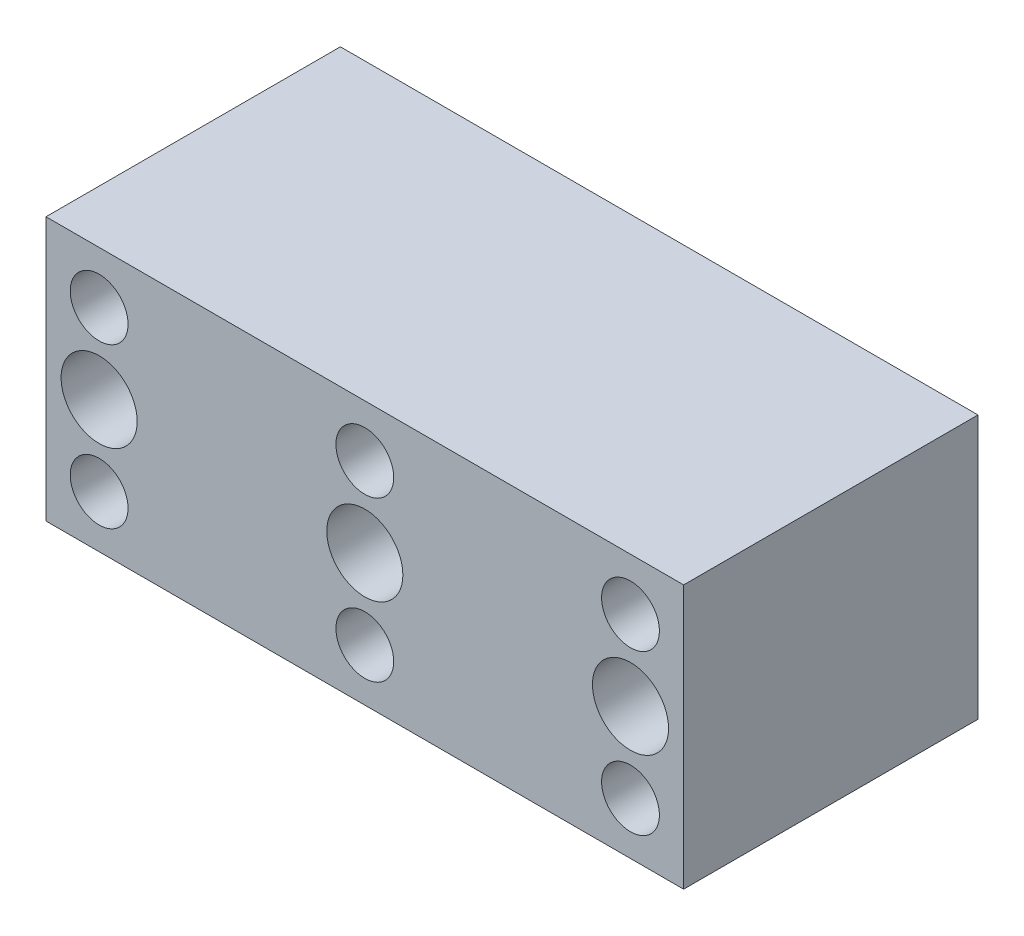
ISO-10303-21;
HEADER;
FILE_DESCRIPTION(('STEP AP214'),'2;1');
FILE_NAME('part.step','',(''),(''),'','','');
FILE_SCHEMA(('AUTOMOTIVE_DESIGN { 1 0 10303 214 1 1 1 1 }'));
ENDSEC;
DATA;
#1=APPLICATION_CONTEXT('core data for automotive mechanical design processes');
#2=APPLICATION_PROTOCOL_DEFINITION('international standard','automotive_design',2000,#1);
#3=PRODUCT_CONTEXT('',#1,'mechanical');
#4=PRODUCT('Part','Part','',(#3));
#5=PRODUCT_RELATED_PRODUCT_CATEGORY('part','',(#4));
#6=PRODUCT_DEFINITION_FORMATION('','',#4);
#7=PRODUCT_DEFINITION_CONTEXT('part definition',#1,'design');
#8=PRODUCT_DEFINITION('design','',#6,#7);
#9=PRODUCT_DEFINITION_SHAPE('','',#8);
#10=(LENGTH_UNIT() NAMED_UNIT(*) SI_UNIT(.MILLI.,.METRE.));
#11=(NAMED_UNIT(*) PLANE_ANGLE_UNIT() SI_UNIT($,.RADIAN.));
#12=(NAMED_UNIT(*) SI_UNIT($,.STERADIAN.) SOLID_ANGLE_UNIT());
#13=UNCERTAINTY_MEASURE_WITH_UNIT(LENGTH_MEASURE(1.E-05),#10,'distance_accuracy_value','');
#14=(GEOMETRIC_REPRESENTATION_CONTEXT(3) GLOBAL_UNCERTAINTY_ASSIGNED_CONTEXT((#13)) GLOBAL_UNIT_ASSIGNED_CONTEXT((#10,
#11,#12)) REPRESENTATION_CONTEXT('',''));
#15=CARTESIAN_POINT('',(0.,0.,0.));
#16=DIRECTION('',(0.,0.,1.));
#17=DIRECTION('',(1.,0.,0.));
#18=AXIS2_PLACEMENT_3D('',#15,#16,#17);
#19=CARTESIAN_POINT('',(6.35,25.273,-35.179));
#20=DIRECTION('',(0.,0.,1.));
#21=DIRECTION('',(1.,0.,0.));
#22=AXIS2_PLACEMENT_3D('',#19,#20,#21);
#23=CYLINDRICAL_SURFACE('',#22,2.1082);
#24=CARTESIAN_POINT('',(6.35,25.273,-35.179));
#25=DIRECTION('',(0.,0.,1.));
#26=DIRECTION('',(1.,0.,0.));
#27=AXIS2_PLACEMENT_3D('',#24,#25,#26);
#28=CIRCLE('',#27,2.1082);
#29=CARTESIAN_POINT('',(8.4582,25.273,-35.179));
#30=VERTEX_POINT('',#29);
#31=EDGE_CURVE('E107',#30,#30,#28,.T.);
#32=ORIENTED_EDGE('',*,*,#31,.F.);
#33=EDGE_LOOP('',(#32));
#34=FACE_BOUND('',#33,.T.);
#35=CARTESIAN_POINT('',(6.35,25.273,-5.08));
#36=DIRECTION('',(0.,0.,1.));
#37=DIRECTION('',(1.,0.,0.));
#38=AXIS2_PLACEMENT_3D('',#35,#36,#37);
#39=CIRCLE('',#38,2.1082);
#40=CARTESIAN_POINT('',(8.4582,25.273,-5.08));
#41=VERTEX_POINT('',#40);
#42=EDGE_CURVE('E39',#41,#41,#39,.F.);
#43=ORIENTED_EDGE('',*,*,#42,.F.);
#44=EDGE_LOOP('',(#43));
#45=FACE_BOUND('',#44,.T.);
#46=ADVANCED_FACE('F35',(#34,#45),#23,.F.);
#47=CARTESIAN_POINT('',(38.1,25.273,-35.179));
#48=DIRECTION('',(0.,0.,1.));
#49=DIRECTION('',(1.,0.,0.));
#50=AXIS2_PLACEMENT_3D('',#47,#48,#49);
#51=CYLINDRICAL_SURFACE('',#50,2.1082);
#52=CARTESIAN_POINT('',(38.1,25.273,-35.179));
#53=DIRECTION('',(0.,0.,1.));
#54=DIRECTION('',(1.,0.,0.));
#55=AXIS2_PLACEMENT_3D('',#52,#53,#54);
#56=CIRCLE('',#55,2.1082);
#57=CARTESIAN_POINT('',(40.2082,25.273,-35.179));
#58=VERTEX_POINT('',#57);
#59=EDGE_CURVE('E144',#58,#58,#56,.T.);
#60=ORIENTED_EDGE('',*,*,#59,.F.);
#61=EDGE_LOOP('',(#60));
#62=FACE_BOUND('',#61,.T.);
#63=CARTESIAN_POINT('',(38.1,25.273,-5.08));
#64=DIRECTION('',(0.,0.,1.));
#65=DIRECTION('',(1.,0.,0.));
#66=AXIS2_PLACEMENT_3D('',#63,#64,#65);
#67=CIRCLE('',#66,2.1082);
#68=CARTESIAN_POINT('',(40.2082,25.273,-5.08));
#69=VERTEX_POINT('',#68);
#70=EDGE_CURVE('E126',#69,#69,#67,.F.);
#71=ORIENTED_EDGE('',*,*,#70,.F.);
#72=EDGE_LOOP('',(#71));
#73=FACE_BOUND('',#72,.T.);
#74=ADVANCED_FACE('F189',(#62,#73),#51,.F.);
#75=CARTESIAN_POINT('',(69.85,25.273,-35.179));
#76=DIRECTION('',(0.,0.,1.));
#77=DIRECTION('',(1.,0.,0.));
#78=AXIS2_PLACEMENT_3D('',#75,#76,#77);
#79=CYLINDRICAL_SURFACE('',#78,2.1082);
#80=CARTESIAN_POINT('',(69.85,25.273,-35.179));
#81=DIRECTION('',(0.,0.,1.));
#82=DIRECTION('',(1.,0.,0.));
#83=AXIS2_PLACEMENT_3D('',#80,#81,#82);
#84=CIRCLE('',#83,2.1082);
#85=CARTESIAN_POINT('',(71.9582,25.273,-35.179));
#86=VERTEX_POINT('',#85);
#87=EDGE_CURVE('E148',#86,#86,#84,.T.);
#88=ORIENTED_EDGE('',*,*,#87,.F.);
#89=EDGE_LOOP('',(#88));
#90=FACE_BOUND('',#89,.T.);
#91=CARTESIAN_POINT('',(69.85,25.273,-5.08));
#92=DIRECTION('',(0.,0.,1.));
#93=DIRECTION('',(1.,0.,0.));
#94=AXIS2_PLACEMENT_3D('',#91,#92,#93);
#95=CIRCLE('',#94,2.1082);
#96=CARTESIAN_POINT('',(71.9582,25.273,-5.08));
#97=VERTEX_POINT('',#96);
#98=EDGE_CURVE('E124',#97,#97,#95,.F.);
#99=ORIENTED_EDGE('',*,*,#98,.F.);
#100=EDGE_LOOP('',(#99));
#101=FACE_BOUND('',#100,.T.);
#102=ADVANCED_FACE('F166',(#90,#101),#79,.F.);
#103=CARTESIAN_POINT('',(69.85,6.223,-35.179));
#104=DIRECTION('',(0.,0.,1.));
#105=DIRECTION('',(1.,0.,0.));
#106=AXIS2_PLACEMENT_3D('',#103,#104,#105);
#107=CYLINDRICAL_SURFACE('',#106,2.1082);
#108=CARTESIAN_POINT('',(69.85,6.223,-35.179));
#109=DIRECTION('',(0.,0.,1.));
#110=DIRECTION('',(1.,0.,0.));
#111=AXIS2_PLACEMENT_3D('',#108,#109,#110);
#112=CIRCLE('',#111,2.1082);
#113=CARTESIAN_POINT('',(71.9582,6.223,-35.179));
#114=VERTEX_POINT('',#113);
#115=EDGE_CURVE('E140',#114,#114,#112,.T.);
#116=ORIENTED_EDGE('',*,*,#115,.F.);
#117=EDGE_LOOP('',(#116));
#118=FACE_BOUND('',#117,.T.);
#119=CARTESIAN_POINT('',(69.85,6.223,-5.08));
#120=DIRECTION('',(0.,0.,1.));
#121=DIRECTION('',(1.,0.,0.));
#122=AXIS2_PLACEMENT_3D('',#119,#120,#121);
#123=CIRCLE('',#122,2.1082);
#124=CARTESIAN_POINT('',(71.9582,6.223,-5.08));
#125=VERTEX_POINT('',#124);
#126=EDGE_CURVE('E121',#125,#125,#123,.F.);
#127=ORIENTED_EDGE('',*,*,#126,.F.);
#128=EDGE_LOOP('',(#127));
#129=FACE_BOUND('',#128,.T.);
#130=ADVANCED_FACE('F162',(#118,#129),#107,.F.);
#131=CARTESIAN_POINT('',(38.1,6.223,-35.179));
#132=DIRECTION('',(0.,0.,1.));
#133=DIRECTION('',(1.,0.,0.));
#134=AXIS2_PLACEMENT_3D('',#131,#132,#133);
#135=CYLINDRICAL_SURFACE('',#134,2.1082);
#136=CARTESIAN_POINT('',(38.1,6.223,-35.179));
#137=DIRECTION('',(0.,0.,1.));
#138=DIRECTION('',(1.,0.,0.));
#139=AXIS2_PLACEMENT_3D('',#136,#137,#138);
#140=CIRCLE('',#139,2.1082);
#141=CARTESIAN_POINT('',(40.2082,6.223,-35.179));
#142=VERTEX_POINT('',#141);
#143=EDGE_CURVE('E135',#142,#142,#140,.T.);
#144=ORIENTED_EDGE('',*,*,#143,.F.);
#145=EDGE_LOOP('',(#144));
#146=FACE_BOUND('',#145,.T.);
#147=CARTESIAN_POINT('',(38.1,6.223,-5.08));
#148=DIRECTION('',(0.,0.,1.));
#149=DIRECTION('',(1.,0.,0.));
#150=AXIS2_PLACEMENT_3D('',#147,#148,#149);
#151=CIRCLE('',#150,2.1082);
#152=CARTESIAN_POINT('',(40.2082,6.223,-5.08));
#153=VERTEX_POINT('',#152);
#154=EDGE_CURVE('E117',#153,#153,#151,.F.);
#155=ORIENTED_EDGE('',*,*,#154,.F.);
#156=EDGE_LOOP('',(#155));
#157=FACE_BOUND('',#156,.T.);
#158=ADVANCED_FACE('F165',(#146,#157),#135,.F.);
#159=CARTESIAN_POINT('',(6.35,6.22299999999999,-35.179));
#160=DIRECTION('',(0.,0.,1.));
#161=DIRECTION('',(1.,0.,0.));
#162=AXIS2_PLACEMENT_3D('',#159,#160,#161);
#163=CYLINDRICAL_SURFACE('',#162,2.1082);
#164=CARTESIAN_POINT('',(6.35,6.22299999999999,-35.179));
#165=DIRECTION('',(0.,0.,1.));
#166=DIRECTION('',(1.,0.,0.));
#167=AXIS2_PLACEMENT_3D('',#164,#165,#166);
#168=CIRCLE('',#167,2.1082);
#169=CARTESIAN_POINT('',(8.4582,6.22299999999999,-35.179));
#170=VERTEX_POINT('',#169);
#171=EDGE_CURVE('E131',#170,#170,#168,.T.);
#172=ORIENTED_EDGE('',*,*,#171,.F.);
#173=EDGE_LOOP('',(#172));
#174=FACE_BOUND('',#173,.T.);
#175=CARTESIAN_POINT('',(6.35,6.22299999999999,-5.08));
#176=DIRECTION('',(0.,0.,1.));
#177=DIRECTION('',(1.,0.,0.));
#178=AXIS2_PLACEMENT_3D('',#175,#176,#177);
#179=CIRCLE('',#178,2.1082);
#180=CARTESIAN_POINT('',(8.4582,6.22299999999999,-5.08));
#181=VERTEX_POINT('',#180);
#182=EDGE_CURVE('E114',#181,#181,#179,.F.);
#183=ORIENTED_EDGE('',*,*,#182,.F.);
#184=EDGE_LOOP('',(#183));
#185=FACE_BOUND('',#184,.T.);
#186=ADVANCED_FACE('F200',(#174,#185),#163,.F.);
#187=CARTESIAN_POINT('',(0.,0.,-35.179));
#188=DIRECTION('',(-1.,0.,0.));
#189=DIRECTION('',(0.,0.,1.));
#190=AXIS2_PLACEMENT_3D('',#187,#188,#189);
#191=PLANE('',#190);
#192=DIRECTION('',(0.,-1.,0.));
#193=VECTOR('',#192,1.);
#194=CARTESIAN_POINT('',(0.,0.,0.));
#195=LINE('',#194,#193);
#196=CARTESIAN_POINT('',(0.,31.496,0.));
#197=VERTEX_POINT('',#196);
#198=CARTESIAN_POINT('',(0.,0.,0.));
#199=VERTEX_POINT('',#198);
#200=EDGE_CURVE('E103',#197,#199,#195,.T.);
#201=ORIENTED_EDGE('',*,*,#200,.F.);
#202=DIRECTION('',(0.,0.,1.));
#203=VECTOR('',#202,1.);
#204=CARTESIAN_POINT('',(0.,31.496,-35.179));
#205=LINE('',#204,#203);
#206=CARTESIAN_POINT('',(0.,31.496,-35.179));
#207=VERTEX_POINT('',#206);
#208=EDGE_CURVE('E11',#207,#197,#205,.T.);
#209=ORIENTED_EDGE('',*,*,#208,.F.);
#210=DIRECTION('',(0.,-1.,0.));
#211=VECTOR('',#210,1.);
#212=CARTESIAN_POINT('',(0.,0.,-35.179));
#213=LINE('',#212,#211);
#214=CARTESIAN_POINT('',(0.,0.,-35.179));
#215=VERTEX_POINT('',#214);
#216=EDGE_CURVE('E96',#207,#215,#213,.T.);
#217=ORIENTED_EDGE('',*,*,#216,.T.);
#218=DIRECTION('',(0.,0.,1.));
#219=VECTOR('',#218,1.);
#220=CARTESIAN_POINT('',(0.,0.,-35.179));
#221=LINE('',#220,#219);
#222=EDGE_CURVE('E79',#215,#199,#221,.T.);
#223=ORIENTED_EDGE('',*,*,#222,.T.);
#224=EDGE_LOOP('',(#201,#209,#217,#223));
#225=FACE_BOUND('',#224,.T.);
#226=ADVANCED_FACE('F37',(#225),#191,.T.);
#227=CARTESIAN_POINT('',(0.,31.496,-35.179));
#228=DIRECTION('',(0.,1.,0.));
#229=DIRECTION('',(0.,0.,1.));
#230=AXIS2_PLACEMENT_3D('',#227,#228,#229);
#231=PLANE('',#230);
#232=DIRECTION('',(-1.,0.,0.));
#233=VECTOR('',#232,1.);
#234=CARTESIAN_POINT('',(0.,31.496,0.));
#235=LINE('',#234,#233);
#236=CARTESIAN_POINT('',(76.2,31.496,0.));
#237=VERTEX_POINT('',#236);
#238=EDGE_CURVE('E98',#237,#197,#235,.T.);
#239=ORIENTED_EDGE('',*,*,#238,.F.);
#240=DIRECTION('',(0.,0.,1.));
#241=VECTOR('',#240,1.);
#242=CARTESIAN_POINT('',(76.2,31.496,-35.179));
#243=LINE('',#242,#241);
#244=CARTESIAN_POINT('',(76.2,31.496,-35.179));
#245=VERTEX_POINT('',#244);
#246=EDGE_CURVE('E45',#245,#237,#243,.T.);
#247=ORIENTED_EDGE('',*,*,#246,.F.);
#248=DIRECTION('',(-1.,0.,0.));
#249=VECTOR('',#248,1.);
#250=CARTESIAN_POINT('',(0.,31.496,-35.179));
#251=LINE('',#250,#249);
#252=EDGE_CURVE('E93',#245,#207,#251,.T.);
#253=ORIENTED_EDGE('',*,*,#252,.T.);
#254=ORIENTED_EDGE('',*,*,#208,.T.);
#255=EDGE_LOOP('',(#239,#247,#253,#254));
#256=FACE_BOUND('',#255,.T.);
#257=ADVANCED_FACE('F210',(#256),#231,.T.);
#258=CARTESIAN_POINT('',(76.2,0.,-35.179));
#259=DIRECTION('',(1.,0.,0.));
#260=DIRECTION('',(0.,0.,-1.));
#261=AXIS2_PLACEMENT_3D('',#258,#259,#260);
#262=PLANE('',#261);
#263=DIRECTION('',(0.,1.,0.));
#264=VECTOR('',#263,1.);
#265=CARTESIAN_POINT('',(76.2,0.,0.));
#266=LINE('',#265,#264);
#267=CARTESIAN_POINT('',(76.2,0.,0.));
#268=VERTEX_POINT('',#267);
#269=EDGE_CURVE('E87',#268,#237,#266,.T.);
#270=ORIENTED_EDGE('',*,*,#269,.F.);
#271=DIRECTION('',(0.,0.,1.));
#272=VECTOR('',#271,1.);
#273=CARTESIAN_POINT('',(76.2,0.,-35.179));
#274=LINE('',#273,#272);
#275=CARTESIAN_POINT('',(76.2,0.,-35.179));
#276=VERTEX_POINT('',#275);
#277=EDGE_CURVE('E82',#276,#268,#274,.T.);
#278=ORIENTED_EDGE('',*,*,#277,.F.);
#279=DIRECTION('',(0.,1.,0.));
#280=VECTOR('',#279,1.);
#281=CARTESIAN_POINT('',(76.2,0.,-35.179));
#282=LINE('',#281,#280);
#283=EDGE_CURVE('E85',#276,#245,#282,.T.);
#284=ORIENTED_EDGE('',*,*,#283,.T.);
#285=ORIENTED_EDGE('',*,*,#246,.T.);
#286=EDGE_LOOP('',(#270,#278,#284,#285));
#287=FACE_BOUND('',#286,.T.);
#288=ADVANCED_FACE('F84',(#287),#262,.T.);
#289=CARTESIAN_POINT('',(0.,0.,-35.179));
#290=DIRECTION('',(0.,-1.,0.));
#291=DIRECTION('',(0.,0.,-1.));
#292=AXIS2_PLACEMENT_3D('',#289,#290,#291);
#293=PLANE('',#292);
#294=DIRECTION('',(1.,0.,0.));
#295=VECTOR('',#294,1.);
#296=CARTESIAN_POINT('',(0.,0.,0.));
#297=LINE('',#296,#295);
#298=EDGE_CURVE('E106',#199,#268,#297,.T.);
#299=ORIENTED_EDGE('',*,*,#298,.F.);
#300=ORIENTED_EDGE('',*,*,#222,.F.);
#301=DIRECTION('',(1.,0.,0.));
#302=VECTOR('',#301,1.);
#303=CARTESIAN_POINT('',(0.,0.,-35.179));
#304=LINE('',#303,#302);
#305=EDGE_CURVE('E92',#215,#276,#304,.T.);
#306=ORIENTED_EDGE('',*,*,#305,.T.);
#307=ORIENTED_EDGE('',*,*,#277,.T.);
#308=EDGE_LOOP('',(#299,#300,#306,#307));
#309=FACE_BOUND('',#308,.T.);
#310=ADVANCED_FACE('F95',(#309),#293,.T.);
#311=CARTESIAN_POINT('',(0.,0.,-35.179));
#312=DIRECTION('',(0.,0.,-1.));
#313=DIRECTION('',(-1.,0.,0.));
#314=AXIS2_PLACEMENT_3D('',#311,#312,#313);
#315=PLANE('',#314);
#316=CARTESIAN_POINT('',(6.35,15.748,-35.179));
#317=DIRECTION('',(0.,0.,1.));
#318=DIRECTION('',(1.,0.,0.));
#319=AXIS2_PLACEMENT_3D('',#316,#317,#318);
#320=CIRCLE('',#319,4.54659999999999);
#321=CARTESIAN_POINT('',(10.8966,15.748,-35.179));
#322=VERTEX_POINT('',#321);
#323=EDGE_CURVE('E365',#322,#322,#320,.T.);
#324=ORIENTED_EDGE('',*,*,#323,.T.);
#325=EDGE_LOOP('',(#324));
#326=FACE_BOUND('',#325,.T.);
#327=CARTESIAN_POINT('',(38.1,15.748,-35.179));
#328=DIRECTION('',(0.,0.,1.));
#329=DIRECTION('',(1.,0.,0.));
#330=AXIS2_PLACEMENT_3D('',#327,#328,#329);
#331=CIRCLE('',#330,4.54659999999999);
#332=CARTESIAN_POINT('',(42.6466,15.748,-35.179));
#333=VERTEX_POINT('',#332);
#334=EDGE_CURVE('E375',#333,#333,#331,.T.);
#335=ORIENTED_EDGE('',*,*,#334,.T.);
#336=EDGE_LOOP('',(#335));
#337=FACE_BOUND('',#336,.T.);
#338=CARTESIAN_POINT('',(69.85,15.748,-35.179));
#339=DIRECTION('',(0.,0.,1.));
#340=DIRECTION('',(1.,0.,0.));
#341=AXIS2_PLACEMENT_3D('',#338,#339,#340);
#342=CIRCLE('',#341,4.5466);
#343=CARTESIAN_POINT('',(74.3966,15.748,-35.179));
#344=VERTEX_POINT('',#343);
#345=EDGE_CURVE('E381',#344,#344,#342,.T.);
#346=ORIENTED_EDGE('',*,*,#345,.T.);
#347=EDGE_LOOP('',(#346));
#348=FACE_BOUND('',#347,.T.);
#349=ORIENTED_EDGE('',*,*,#171,.T.);
#350=EDGE_LOOP('',(#349));
#351=FACE_BOUND('',#350,.T.);
#352=ORIENTED_EDGE('',*,*,#143,.T.);
#353=EDGE_LOOP('',(#352));
#354=FACE_BOUND('',#353,.T.);
#355=ORIENTED_EDGE('',*,*,#115,.T.);
#356=EDGE_LOOP('',(#355));
#357=FACE_BOUND('',#356,.T.);
#358=ORIENTED_EDGE('',*,*,#87,.T.);
#359=EDGE_LOOP('',(#358));
#360=FACE_BOUND('',#359,.T.);
#361=ORIENTED_EDGE('',*,*,#59,.T.);
#362=EDGE_LOOP('',(#361));
#363=FACE_BOUND('',#362,.T.);
#364=ORIENTED_EDGE('',*,*,#31,.T.);
#365=EDGE_LOOP('',(#364));
#366=FACE_BOUND('',#365,.T.);
#367=ORIENTED_EDGE('',*,*,#216,.F.);
#368=ORIENTED_EDGE('',*,*,#252,.F.);
#369=ORIENTED_EDGE('',*,*,#283,.F.);
#370=ORIENTED_EDGE('',*,*,#305,.F.);
#371=EDGE_LOOP('',(#367,#368,#369,#370));
#372=FACE_BOUND('',#371,.T.);
#373=ADVANCED_FACE('F91',(#326,#337,#348,#351,#354,#357,#360,#363,#366,#372),#315,.T.);
#374=CARTESIAN_POINT('',(0.,0.,0.));
#375=DIRECTION('',(0.,0.,-1.));
#376=DIRECTION('',(-1.,0.,0.));
#377=AXIS2_PLACEMENT_3D('',#374,#375,#376);
#378=PLANE('',#377);
#379=CARTESIAN_POINT('',(6.35,15.748,0.));
#380=DIRECTION('',(0.,0.,1.));
#381=DIRECTION('',(1.,0.,0.));
#382=AXIS2_PLACEMENT_3D('',#379,#380,#381);
#383=CIRCLE('',#382,4.5466);
#384=CARTESIAN_POINT('',(10.8966,15.748,0.));
#385=VERTEX_POINT('',#384);
#386=EDGE_CURVE('E368',#385,#385,#383,.T.);
#387=ORIENTED_EDGE('',*,*,#386,.F.);
#388=EDGE_LOOP('',(#387));
#389=FACE_BOUND('',#388,.T.);
#390=CARTESIAN_POINT('',(38.1,15.748,0.));
#391=DIRECTION('',(0.,0.,1.));
#392=DIRECTION('',(1.,0.,0.));
#393=AXIS2_PLACEMENT_3D('',#390,#391,#392);
#394=CIRCLE('',#393,4.5466);
#395=CARTESIAN_POINT('',(42.6466,15.748,0.));
#396=VERTEX_POINT('',#395);
#397=EDGE_CURVE('E370',#396,#396,#394,.T.);
#398=ORIENTED_EDGE('',*,*,#397,.F.);
#399=EDGE_LOOP('',(#398));
#400=FACE_BOUND('',#399,.T.);
#401=CARTESIAN_POINT('',(69.85,15.748,0.));
#402=DIRECTION('',(0.,0.,1.));
#403=DIRECTION('',(1.,0.,0.));
#404=AXIS2_PLACEMENT_3D('',#401,#402,#403);
#405=CIRCLE('',#404,4.5466);
#406=CARTESIAN_POINT('',(74.3966,15.748,0.));
#407=VERTEX_POINT('',#406);
#408=EDGE_CURVE('E378',#407,#407,#405,.T.);
#409=ORIENTED_EDGE('',*,*,#408,.F.);
#410=EDGE_LOOP('',(#409));
#411=FACE_BOUND('',#410,.T.);
#412=CARTESIAN_POINT('',(6.35,6.22299999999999,0.));
#413=DIRECTION('',(0.,0.,1.));
#414=DIRECTION('',(1.,0.,0.));
#415=AXIS2_PLACEMENT_3D('',#412,#413,#414);
#416=CIRCLE('',#415,3.4544);
#417=CARTESIAN_POINT('',(9.8044,6.22299999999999,0.));
#418=VERTEX_POINT('',#417);
#419=EDGE_CURVE('E384',#418,#418,#416,.T.);
#420=ORIENTED_EDGE('',*,*,#419,.F.);
#421=EDGE_LOOP('',(#420));
#422=FACE_BOUND('',#421,.T.);
#423=CARTESIAN_POINT('',(38.1,6.223,0.));
#424=DIRECTION('',(0.,0.,1.));
#425=DIRECTION('',(1.,0.,0.));
#426=AXIS2_PLACEMENT_3D('',#423,#424,#425);
#427=CIRCLE('',#426,3.4544);
#428=CARTESIAN_POINT('',(41.5544,6.223,0.));
#429=VERTEX_POINT('',#428);
#430=EDGE_CURVE('E405',#429,#429,#427,.T.);
#431=ORIENTED_EDGE('',*,*,#430,.F.);
#432=EDGE_LOOP('',(#431));
#433=FACE_BOUND('',#432,.T.);
#434=CARTESIAN_POINT('',(69.85,6.223,0.));
#435=DIRECTION('',(0.,0.,1.));
#436=DIRECTION('',(1.,0.,0.));
#437=AXIS2_PLACEMENT_3D('',#434,#435,#436);
#438=CIRCLE('',#437,3.4544);
#439=CARTESIAN_POINT('',(73.3044,6.223,0.));
#440=VERTEX_POINT('',#439);
#441=EDGE_CURVE('E399',#440,#440,#438,.T.);
#442=ORIENTED_EDGE('',*,*,#441,.F.);
#443=EDGE_LOOP('',(#442));
#444=FACE_BOUND('',#443,.T.);
#445=CARTESIAN_POINT('',(69.85,25.273,0.));
#446=DIRECTION('',(0.,0.,1.));
#447=DIRECTION('',(1.,0.,0.));
#448=AXIS2_PLACEMENT_3D('',#445,#446,#447);
#449=CIRCLE('',#448,3.4544);
#450=CARTESIAN_POINT('',(73.3044,25.273,0.));
#451=VERTEX_POINT('',#450);
#452=EDGE_CURVE('E394',#451,#451,#449,.T.);
#453=ORIENTED_EDGE('',*,*,#452,.F.);
#454=EDGE_LOOP('',(#453));
#455=FACE_BOUND('',#454,.T.);
#456=CARTESIAN_POINT('',(38.1,25.273,0.));
#457=DIRECTION('',(0.,0.,1.));
#458=DIRECTION('',(1.,0.,0.));
#459=AXIS2_PLACEMENT_3D('',#456,#457,#458);
#460=CIRCLE('',#459,3.4544);
#461=CARTESIAN_POINT('',(41.5544,25.273,0.));
#462=VERTEX_POINT('',#461);
#463=EDGE_CURVE('E388',#462,#462,#460,.T.);
#464=ORIENTED_EDGE('',*,*,#463,.F.);
#465=EDGE_LOOP('',(#464));
#466=FACE_BOUND('',#465,.T.);
#467=CARTESIAN_POINT('',(6.35,25.273,0.));
#468=DIRECTION('',(0.,0.,1.));
#469=DIRECTION('',(1.,0.,0.));
#470=AXIS2_PLACEMENT_3D('',#467,#468,#469);
#471=CIRCLE('',#470,3.4544);
#472=CARTESIAN_POINT('',(9.8044,25.273,0.));
#473=VERTEX_POINT('',#472);
#474=EDGE_CURVE('E155',#473,#473,#471,.T.);
#475=ORIENTED_EDGE('',*,*,#474,.F.);
#476=EDGE_LOOP('',(#475));
#477=FACE_BOUND('',#476,.T.);
#478=ORIENTED_EDGE('',*,*,#200,.T.);
#479=ORIENTED_EDGE('',*,*,#298,.T.);
#480=ORIENTED_EDGE('',*,*,#269,.T.);
#481=ORIENTED_EDGE('',*,*,#238,.T.);
#482=EDGE_LOOP('',(#478,#479,#480,#481));
#483=FACE_BOUND('',#482,.T.);
#484=ADVANCED_FACE('F204',(#389,#400,#411,#422,#433,#444,#455,#466,#477,#483),#378,.F.);
#485=CARTESIAN_POINT('',(6.35,6.22299999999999,-5.08));
#486=DIRECTION('',(0.,0.,1.));
#487=DIRECTION('',(1.,0.,0.));
#488=AXIS2_PLACEMENT_3D('',#485,#486,#487);
#489=PLANE('',#488);
#490=CARTESIAN_POINT('',(6.35,6.22299999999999,-5.08));
#491=DIRECTION('',(0.,0.,1.));
#492=DIRECTION('',(1.,0.,0.));
#493=AXIS2_PLACEMENT_3D('',#490,#491,#492);
#494=CIRCLE('',#493,3.4544);
#495=CARTESIAN_POINT('',(9.8044,6.22299999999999,-5.08));
#496=VERTEX_POINT('',#495);
#497=EDGE_CURVE('E408',#496,#496,#494,.T.);
#498=ORIENTED_EDGE('',*,*,#497,.T.);
#499=EDGE_LOOP('',(#498));
#500=FACE_BOUND('',#499,.T.);
#501=ORIENTED_EDGE('',*,*,#182,.T.);
#502=EDGE_LOOP('',(#501));
#503=FACE_BOUND('',#502,.T.);
#504=ADVANCED_FACE('F208',(#500,#503),#489,.T.);
#505=CARTESIAN_POINT('',(6.35,6.22299999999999,-5.08));
#506=DIRECTION('',(0.,0.,1.));
#507=DIRECTION('',(1.,0.,0.));
#508=AXIS2_PLACEMENT_3D('',#505,#506,#507);
#509=CYLINDRICAL_SURFACE('',#508,3.4544);
#510=ORIENTED_EDGE('',*,*,#497,.F.);
#511=EDGE_LOOP('',(#510));
#512=FACE_BOUND('',#511,.T.);
#513=ORIENTED_EDGE('',*,*,#419,.T.);
#514=EDGE_LOOP('',(#513));
#515=FACE_BOUND('',#514,.T.);
#516=ADVANCED_FACE('F235',(#512,#515),#509,.F.);
#517=CARTESIAN_POINT('',(38.1,6.223,-5.08));
#518=DIRECTION('',(0.,0.,1.));
#519=DIRECTION('',(1.,0.,0.));
#520=AXIS2_PLACEMENT_3D('',#517,#518,#519);
#521=PLANE('',#520);
#522=CARTESIAN_POINT('',(38.1,6.223,-5.08));
#523=DIRECTION('',(0.,0.,1.));
#524=DIRECTION('',(1.,0.,0.));
#525=AXIS2_PLACEMENT_3D('',#522,#523,#524);
#526=CIRCLE('',#525,3.4544);
#527=CARTESIAN_POINT('',(41.5544,6.223,-5.08));
#528=VERTEX_POINT('',#527);
#529=EDGE_CURVE('E402',#528,#528,#526,.T.);
#530=ORIENTED_EDGE('',*,*,#529,.T.);
#531=EDGE_LOOP('',(#530));
#532=FACE_BOUND('',#531,.T.);
#533=ORIENTED_EDGE('',*,*,#154,.T.);
#534=EDGE_LOOP('',(#533));
#535=FACE_BOUND('',#534,.T.);
#536=ADVANCED_FACE('F183',(#532,#535),#521,.T.);
#537=CARTESIAN_POINT('',(38.1,6.223,-5.08));
#538=DIRECTION('',(0.,0.,1.));
#539=DIRECTION('',(1.,0.,0.));
#540=AXIS2_PLACEMENT_3D('',#537,#538,#539);
#541=CYLINDRICAL_SURFACE('',#540,3.4544);
#542=ORIENTED_EDGE('',*,*,#529,.F.);
#543=EDGE_LOOP('',(#542));
#544=FACE_BOUND('',#543,.T.);
#545=ORIENTED_EDGE('',*,*,#430,.T.);
#546=EDGE_LOOP('',(#545));
#547=FACE_BOUND('',#546,.T.);
#548=ADVANCED_FACE('F173',(#544,#547),#541,.F.);
#549=CARTESIAN_POINT('',(69.85,6.223,-5.08));
#550=DIRECTION('',(0.,0.,1.));
#551=DIRECTION('',(1.,0.,0.));
#552=AXIS2_PLACEMENT_3D('',#549,#550,#551);
#553=PLANE('',#552);
#554=CARTESIAN_POINT('',(69.85,6.223,-5.08));
#555=DIRECTION('',(0.,0.,1.));
#556=DIRECTION('',(1.,0.,0.));
#557=AXIS2_PLACEMENT_3D('',#554,#555,#556);
#558=CIRCLE('',#557,3.4544);
#559=CARTESIAN_POINT('',(73.3044,6.223,-5.08));
#560=VERTEX_POINT('',#559);
#561=EDGE_CURVE('E397',#560,#560,#558,.T.);
#562=ORIENTED_EDGE('',*,*,#561,.T.);
#563=EDGE_LOOP('',(#562));
#564=FACE_BOUND('',#563,.T.);
#565=ORIENTED_EDGE('',*,*,#126,.T.);
#566=EDGE_LOOP('',(#565));
#567=FACE_BOUND('',#566,.T.);
#568=ADVANCED_FACE('F170',(#564,#567),#553,.T.);
#569=CARTESIAN_POINT('',(69.85,6.223,-5.08));
#570=DIRECTION('',(0.,0.,1.));
#571=DIRECTION('',(1.,0.,0.));
#572=AXIS2_PLACEMENT_3D('',#569,#570,#571);
#573=CYLINDRICAL_SURFACE('',#572,3.4544);
#574=ORIENTED_EDGE('',*,*,#561,.F.);
#575=EDGE_LOOP('',(#574));
#576=FACE_BOUND('',#575,.T.);
#577=ORIENTED_EDGE('',*,*,#441,.T.);
#578=EDGE_LOOP('',(#577));
#579=FACE_BOUND('',#578,.T.);
#580=ADVANCED_FACE('F172',(#576,#579),#573,.F.);
#581=CARTESIAN_POINT('',(69.85,25.273,-5.08));
#582=DIRECTION('',(0.,0.,1.));
#583=DIRECTION('',(1.,0.,0.));
#584=AXIS2_PLACEMENT_3D('',#581,#582,#583);
#585=PLANE('',#584);
#586=CARTESIAN_POINT('',(69.85,25.273,-5.08));
#587=DIRECTION('',(0.,0.,1.));
#588=DIRECTION('',(1.,0.,0.));
#589=AXIS2_PLACEMENT_3D('',#586,#587,#588);
#590=CIRCLE('',#589,3.4544);
#591=CARTESIAN_POINT('',(73.3044,25.273,-5.08));
#592=VERTEX_POINT('',#591);
#593=EDGE_CURVE('E391',#592,#592,#590,.T.);
#594=ORIENTED_EDGE('',*,*,#593,.T.);
#595=EDGE_LOOP('',(#594));
#596=FACE_BOUND('',#595,.T.);
#597=ORIENTED_EDGE('',*,*,#98,.T.);
#598=EDGE_LOOP('',(#597));
#599=FACE_BOUND('',#598,.T.);
#600=ADVANCED_FACE('F180',(#596,#599),#585,.T.);
#601=CARTESIAN_POINT('',(69.85,25.273,-5.08));
#602=DIRECTION('',(0.,0.,1.));
#603=DIRECTION('',(1.,0.,0.));
#604=AXIS2_PLACEMENT_3D('',#601,#602,#603);
#605=CYLINDRICAL_SURFACE('',#604,3.4544);
#606=ORIENTED_EDGE('',*,*,#593,.F.);
#607=EDGE_LOOP('',(#606));
#608=FACE_BOUND('',#607,.T.);
#609=ORIENTED_EDGE('',*,*,#452,.T.);
#610=EDGE_LOOP('',(#609));
#611=FACE_BOUND('',#610,.T.);
#612=ADVANCED_FACE('F275',(#608,#611),#605,.F.);
#613=CARTESIAN_POINT('',(38.1,25.273,-5.08));
#614=DIRECTION('',(0.,0.,1.));
#615=DIRECTION('',(1.,0.,0.));
#616=AXIS2_PLACEMENT_3D('',#613,#614,#615);
#617=PLANE('',#616);
#618=CARTESIAN_POINT('',(38.1,25.273,-5.08));
#619=DIRECTION('',(0.,0.,1.));
#620=DIRECTION('',(1.,0.,0.));
#621=AXIS2_PLACEMENT_3D('',#618,#619,#620);
#622=CIRCLE('',#621,3.4544);
#623=CARTESIAN_POINT('',(41.5544,25.273,-5.08));
#624=VERTEX_POINT('',#623);
#625=EDGE_CURVE('E385',#624,#624,#622,.T.);
#626=ORIENTED_EDGE('',*,*,#625,.T.);
#627=EDGE_LOOP('',(#626));
#628=FACE_BOUND('',#627,.T.);
#629=ORIENTED_EDGE('',*,*,#70,.T.);
#630=EDGE_LOOP('',(#629));
#631=FACE_BOUND('',#630,.T.);
#632=ADVANCED_FACE('F285',(#628,#631),#617,.T.);
#633=CARTESIAN_POINT('',(38.1,25.273,-5.08));
#634=DIRECTION('',(0.,0.,1.));
#635=DIRECTION('',(1.,0.,0.));
#636=AXIS2_PLACEMENT_3D('',#633,#634,#635);
#637=CYLINDRICAL_SURFACE('',#636,3.4544);
#638=ORIENTED_EDGE('',*,*,#625,.F.);
#639=EDGE_LOOP('',(#638));
#640=FACE_BOUND('',#639,.T.);
#641=ORIENTED_EDGE('',*,*,#463,.T.);
#642=EDGE_LOOP('',(#641));
#643=FACE_BOUND('',#642,.T.);
#644=ADVANCED_FACE('F294',(#640,#643),#637,.F.);
#645=CARTESIAN_POINT('',(6.35,25.273,-5.08));
#646=DIRECTION('',(0.,0.,1.));
#647=DIRECTION('',(1.,0.,0.));
#648=AXIS2_PLACEMENT_3D('',#645,#646,#647);
#649=PLANE('',#648);
#650=CARTESIAN_POINT('',(6.35,25.273,-5.08));
#651=DIRECTION('',(0.,0.,1.));
#652=DIRECTION('',(1.,0.,0.));
#653=AXIS2_PLACEMENT_3D('',#650,#651,#652);
#654=CIRCLE('',#653,3.4544);
#655=CARTESIAN_POINT('',(9.8044,25.273,-5.08));
#656=VERTEX_POINT('',#655);
#657=EDGE_CURVE('E118',#656,#656,#654,.T.);
#658=ORIENTED_EDGE('',*,*,#657,.T.);
#659=EDGE_LOOP('',(#658));
#660=FACE_BOUND('',#659,.T.);
#661=ORIENTED_EDGE('',*,*,#42,.T.);
#662=EDGE_LOOP('',(#661));
#663=FACE_BOUND('',#662,.T.);
#664=ADVANCED_FACE('F304',(#660,#663),#649,.T.);
#665=CARTESIAN_POINT('',(6.35,25.273,-5.08));
#666=DIRECTION('',(0.,0.,1.));
#667=DIRECTION('',(1.,0.,0.));
#668=AXIS2_PLACEMENT_3D('',#665,#666,#667);
#669=CYLINDRICAL_SURFACE('',#668,3.4544);
#670=ORIENTED_EDGE('',*,*,#657,.F.);
#671=EDGE_LOOP('',(#670));
#672=FACE_BOUND('',#671,.T.);
#673=ORIENTED_EDGE('',*,*,#474,.T.);
#674=EDGE_LOOP('',(#673));
#675=FACE_BOUND('',#674,.T.);
#676=ADVANCED_FACE('F313',(#672,#675),#669,.F.);
#677=CARTESIAN_POINT('',(69.85,15.748,0.));
#678=DIRECTION('',(0.,0.,1.));
#679=DIRECTION('',(1.,0.,0.));
#680=AXIS2_PLACEMENT_3D('',#677,#678,#679);
#681=CYLINDRICAL_SURFACE('',#680,4.5466);
#682=ORIENTED_EDGE('',*,*,#345,.F.);
#683=EDGE_LOOP('',(#682));
#684=FACE_BOUND('',#683,.T.);
#685=ORIENTED_EDGE('',*,*,#408,.T.);
#686=EDGE_LOOP('',(#685));
#687=FACE_BOUND('',#686,.T.);
#688=ADVANCED_FACE('F322',(#684,#687),#681,.F.);
#689=CARTESIAN_POINT('',(38.1,15.748,0.));
#690=DIRECTION('',(0.,0.,1.));
#691=DIRECTION('',(1.,0.,0.));
#692=AXIS2_PLACEMENT_3D('',#689,#690,#691);
#693=CYLINDRICAL_SURFACE('',#692,4.54659999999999);
#694=ORIENTED_EDGE('',*,*,#334,.F.);
#695=EDGE_LOOP('',(#694));
#696=FACE_BOUND('',#695,.T.);
#697=ORIENTED_EDGE('',*,*,#397,.T.);
#698=EDGE_LOOP('',(#697));
#699=FACE_BOUND('',#698,.T.);
#700=ADVANCED_FACE('F333',(#696,#699),#693,.F.);
#701=CARTESIAN_POINT('',(6.35,15.748,0.));
#702=DIRECTION('',(0.,0.,1.));
#703=DIRECTION('',(1.,0.,0.));
#704=AXIS2_PLACEMENT_3D('',#701,#702,#703);
#705=CYLINDRICAL_SURFACE('',#704,4.5466);
#706=ORIENTED_EDGE('',*,*,#323,.F.);
#707=EDGE_LOOP('',(#706));
#708=FACE_BOUND('',#707,.T.);
#709=ORIENTED_EDGE('',*,*,#386,.T.);
#710=EDGE_LOOP('',(#709));
#711=FACE_BOUND('',#710,.T.);
#712=ADVANCED_FACE('F340',(#708,#711),#705,.F.);
#713=CLOSED_SHELL('',(#46,#74,#102,#130,#158,#186,#226,#257,#288,#310,#373,#484,#504,#516,#536,
#548,#568,#580,#600,#612,#632,#644,#664,#676,#688,#700,#712));
#714=MANIFOLD_SOLID_BREP('B2',#713);
#715=ADVANCED_BREP_SHAPE_REPRESENTATION('',(#18,#714),#14);
#716=SHAPE_DEFINITION_REPRESENTATION(#9,#715);
ENDSEC;
END-ISO-10303-21;
